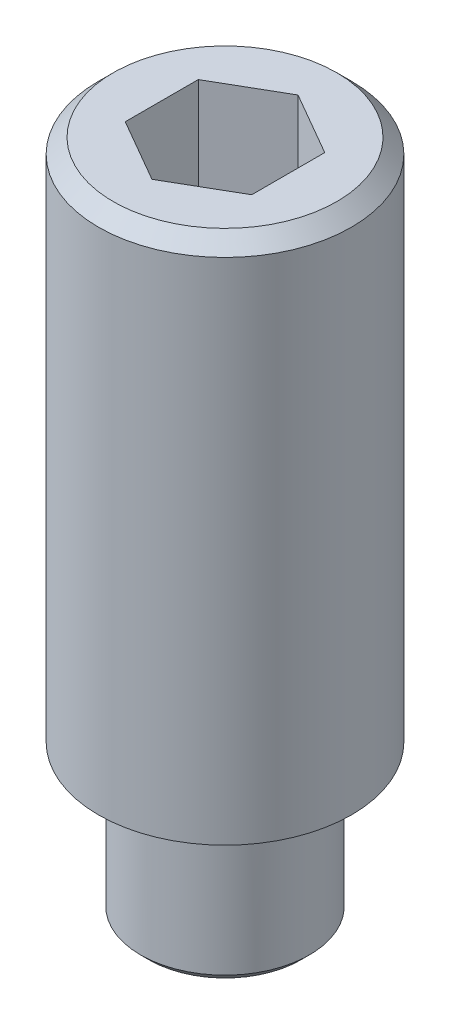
from build123d import *

# Parameters (mm, degrees)
ENL_V_MAT_EXTRU_1_DEPTH = 2.5
CHANFREIN1_SIZE         = 0.2
CHANFREIN2_SIZE         = 0.35


with BuildPart() as part:
    # Esquisse1 → R_volution1 (revolve)
    with BuildSketch(Plane.XY, mode=Mode.PRIVATE) as r_volution1_sk:
        Polygon((0, 0), (-2, 0), (-2, 3), (-3, 3.577350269), (-3, 16), (0, 16), align=None)
    revolve(r_volution1_sk.sketch.rotate(Axis((0, 0, 0), (0, 1, 0)), 270), axis=Axis((0, 0, 0), (0, 1, 0)))

    # Esquisse2 → Enl_v. mat.-Extru.1 (cut)
    with BuildSketch(Plane(origin=(0, 16, 0), x_dir=(1, 0, 0), z_dir=(0, 1, 0))):
        Polygon((1.5, -0.866025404), (1.5, 0.866025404), (0, 1.732050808), (-1.5, 0.866025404), (-1.5, -0.866025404), (0, -1.732050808), align=None)
    extrude(amount=-ENL_V_MAT_EXTRU_1_DEPTH, mode=Mode.SUBTRACT)

    # Chanfrein1
    chanfrein1_edges = [part.edges().sort_by_distance(p)[0] for p in [
        (0, 0, 2),
    ]]
    chamfer(chanfrein1_edges, length=CHANFREIN1_SIZE)

    # Chanfrein2
    chanfrein2_edges = [part.edges().sort_by_distance(p)[0] for p in [
        (0, 16, 3),
    ]]
    chamfer(chanfrein2_edges, length=CHANFREIN2_SIZE)


solid = part.part
